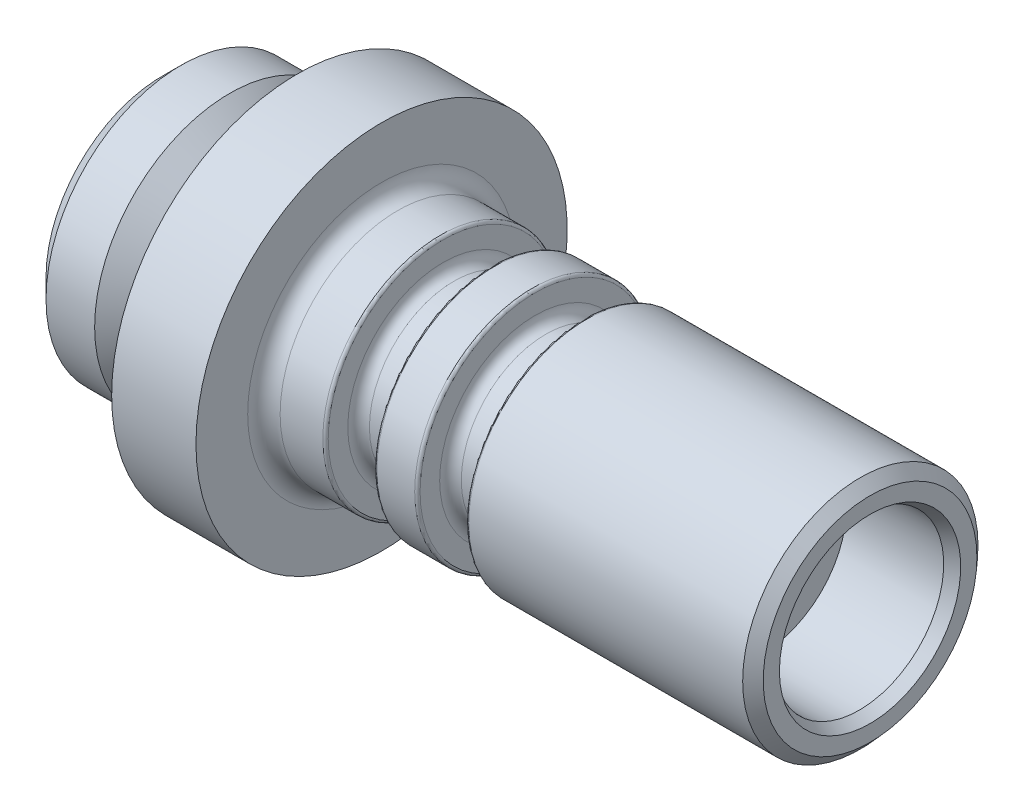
ISO-10303-21;
HEADER;
FILE_DESCRIPTION(('STEP AP214'),'2;1');
FILE_NAME('part.step','',(''),(''),'','','');
FILE_SCHEMA(('AUTOMOTIVE_DESIGN { 1 0 10303 214 1 1 1 1 }'));
ENDSEC;
DATA;
#1=APPLICATION_CONTEXT('core data for automotive mechanical design processes');
#2=APPLICATION_PROTOCOL_DEFINITION('international standard','automotive_design',2000,#1);
#3=PRODUCT_CONTEXT('',#1,'mechanical');
#4=PRODUCT('Part','Part','',(#3));
#5=PRODUCT_RELATED_PRODUCT_CATEGORY('part','',(#4));
#6=PRODUCT_DEFINITION_FORMATION('','',#4);
#7=PRODUCT_DEFINITION_CONTEXT('part definition',#1,'design');
#8=PRODUCT_DEFINITION('design','',#6,#7);
#9=PRODUCT_DEFINITION_SHAPE('','',#8);
#10=(LENGTH_UNIT() NAMED_UNIT(*) SI_UNIT(.MILLI.,.METRE.));
#11=(NAMED_UNIT(*) PLANE_ANGLE_UNIT() SI_UNIT($,.RADIAN.));
#12=(NAMED_UNIT(*) SI_UNIT($,.STERADIAN.) SOLID_ANGLE_UNIT());
#13=UNCERTAINTY_MEASURE_WITH_UNIT(LENGTH_MEASURE(1.E-05),#10,'distance_accuracy_value','');
#14=(GEOMETRIC_REPRESENTATION_CONTEXT(3) GLOBAL_UNCERTAINTY_ASSIGNED_CONTEXT((#13)) GLOBAL_UNIT_ASSIGNED_CONTEXT((#10,
#11,#12)) REPRESENTATION_CONTEXT('',''));
#15=CARTESIAN_POINT('',(0.,0.,0.));
#16=DIRECTION('',(0.,0.,1.));
#17=DIRECTION('',(1.,0.,0.));
#18=AXIS2_PLACEMENT_3D('',#15,#16,#17);
#19=CARTESIAN_POINT('',(33.274,0.,0.));
#20=DIRECTION('',(1.,0.,0.));
#21=DIRECTION('',(0.,0.,-1.));
#22=AXIS2_PLACEMENT_3D('',#19,#20,#21);
#23=PLANE('',#22);
#24=CARTESIAN_POINT('',(33.274,0.,0.));
#25=DIRECTION('',(1.,0.,0.));
#26=DIRECTION('',(0.,0.,-1.));
#27=AXIS2_PLACEMENT_3D('',#24,#25,#26);
#28=CIRCLE('',#27,5.02285);
#29=CARTESIAN_POINT('',(33.274,0.,-5.02285));
#30=VERTEX_POINT('',#29);
#31=EDGE_CURVE('E42',#30,#30,#28,.T.);
#32=ORIENTED_EDGE('',*,*,#31,.T.);
#33=EDGE_LOOP('',(#32));
#34=FACE_BOUND('',#33,.T.);
#35=CARTESIAN_POINT('',(33.274,0.,0.));
#36=DIRECTION('',(-1.,0.,0.));
#37=DIRECTION('',(0.,0.,1.));
#38=AXIS2_PLACEMENT_3D('',#35,#36,#37);
#39=CIRCLE('',#38,4.26204393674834);
#40=CARTESIAN_POINT('',(33.274,0.,4.26204393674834));
#41=VERTEX_POINT('',#40);
#42=EDGE_CURVE('E52',#41,#41,#39,.T.);
#43=ORIENTED_EDGE('',*,*,#42,.T.);
#44=EDGE_LOOP('',(#43));
#45=FACE_BOUND('',#44,.T.);
#46=ADVANCED_FACE('F31',(#34,#45),#23,.T.);
#47=CARTESIAN_POINT('',(33.274,0.,0.));
#48=DIRECTION('',(-1.,0.,0.));
#49=DIRECTION('',(0.,0.,1.));
#50=AXIS2_PLACEMENT_3D('',#47,#48,#49);
#51=CYLINDRICAL_SURFACE('',#50,2.7051);
#52=CARTESIAN_POINT('',(10.3509678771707,0.,0.));
#53=DIRECTION('',(-1.,0.,0.));
#54=DIRECTION('',(0.,0.,1.));
#55=AXIS2_PLACEMENT_3D('',#52,#53,#54);
#56=CIRCLE('',#55,2.7051);
#57=CARTESIAN_POINT('',(10.3509678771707,0.,2.7051));
#58=VERTEX_POINT('',#57);
#59=EDGE_CURVE('E49',#58,#58,#56,.F.);
#60=ORIENTED_EDGE('',*,*,#59,.F.);
#61=EDGE_LOOP('',(#60));
#62=FACE_BOUND('',#61,.T.);
#63=CARTESIAN_POINT('',(28.194,0.,0.));
#64=DIRECTION('',(1.,0.,0.));
#65=DIRECTION('',(0.,0.,-1.));
#66=AXIS2_PLACEMENT_3D('',#63,#64,#65);
#67=CIRCLE('',#66,2.7051);
#68=CARTESIAN_POINT('',(28.194,0.,-2.7051));
#69=VERTEX_POINT('',#68);
#70=EDGE_CURVE('E54',#69,#69,#67,.T.);
#71=ORIENTED_EDGE('',*,*,#70,.T.);
#72=EDGE_LOOP('',(#71));
#73=FACE_BOUND('',#72,.T.);
#74=ADVANCED_FACE('F162',(#62,#73),#51,.F.);
#75=CARTESIAN_POINT('',(0.,0.,0.));
#76=DIRECTION('',(-1.,0.,0.));
#77=DIRECTION('',(0.,0.,1.));
#78=AXIS2_PLACEMENT_3D('',#75,#76,#77);
#79=CYLINDRICAL_SURFACE('',#78,5.53085);
#80=CARTESIAN_POINT('',(11.0744,0.,0.));
#81=DIRECTION('',(1.,0.,0.));
#82=DIRECTION('',(0.,0.,-1.));
#83=AXIS2_PLACEMENT_3D('',#80,#81,#82);
#84=CIRCLE('',#83,5.53085);
#85=CARTESIAN_POINT('',(11.0744,0.,-5.53085));
#86=VERTEX_POINT('',#85);
#87=EDGE_CURVE('E67',#86,#86,#84,.T.);
#88=ORIENTED_EDGE('',*,*,#87,.T.);
#89=EDGE_LOOP('',(#88));
#90=FACE_BOUND('',#89,.T.);
#91=CARTESIAN_POINT('',(13.081,0.,0.));
#92=DIRECTION('',(-1.,0.,0.));
#93=DIRECTION('',(0.,0.,1.));
#94=AXIS2_PLACEMENT_3D('',#91,#92,#93);
#95=CIRCLE('',#94,5.53085);
#96=CARTESIAN_POINT('',(13.081,0.,5.53085));
#97=VERTEX_POINT('',#96);
#98=EDGE_CURVE('E130',#97,#97,#95,.T.);
#99=ORIENTED_EDGE('',*,*,#98,.T.);
#100=EDGE_LOOP('',(#99));
#101=FACE_BOUND('',#100,.T.);
#102=ADVANCED_FACE('F168',(#90,#101),#79,.T.);
#103=CARTESIAN_POINT('',(15.621,0.,0.));
#104=DIRECTION('',(-1.,0.,0.));
#105=DIRECTION('',(0.,0.,1.));
#106=AXIS2_PLACEMENT_3D('',#103,#104,#105);
#107=CIRCLE('',#106,5.53085);
#108=CARTESIAN_POINT('',(15.621,0.,5.53085));
#109=VERTEX_POINT('',#108);
#110=EDGE_CURVE('E127',#109,#109,#107,.T.);
#111=ORIENTED_EDGE('',*,*,#110,.F.);
#112=EDGE_LOOP('',(#111));
#113=FACE_BOUND('',#112,.T.);
#114=CARTESIAN_POINT('',(17.399,0.,0.));
#115=DIRECTION('',(-1.,0.,0.));
#116=DIRECTION('',(0.,0.,1.));
#117=AXIS2_PLACEMENT_3D('',#114,#115,#116);
#118=CIRCLE('',#117,5.53085);
#119=CARTESIAN_POINT('',(17.399,0.,5.53085));
#120=VERTEX_POINT('',#119);
#121=EDGE_CURVE('E91',#120,#120,#118,.T.);
#122=ORIENTED_EDGE('',*,*,#121,.T.);
#123=EDGE_LOOP('',(#122));
#124=FACE_BOUND('',#123,.T.);
#125=ADVANCED_FACE('F182',(#113,#124),#79,.T.);
#126=CARTESIAN_POINT('',(33.274,0.,0.));
#127=DIRECTION('',(-1.,0.,0.));
#128=DIRECTION('',(0.,0.,1.));
#129=AXIS2_PLACEMENT_3D('',#126,#127,#128);
#130=CYLINDRICAL_SURFACE('',#129,8.7249);
#131=CARTESIAN_POINT('',(6.35,0.,0.));
#132=DIRECTION('',(-1.,0.,0.));
#133=DIRECTION('',(0.,0.,1.));
#134=AXIS2_PLACEMENT_3D('',#131,#132,#133);
#135=CIRCLE('',#134,8.7249);
#136=CARTESIAN_POINT('',(6.35,0.,8.7249));
#137=VERTEX_POINT('',#136);
#138=EDGE_CURVE('E73',#137,#137,#135,.T.);
#139=ORIENTED_EDGE('',*,*,#138,.F.);
#140=EDGE_LOOP('',(#139));
#141=FACE_BOUND('',#140,.T.);
#142=CARTESIAN_POINT('',(10.3124,0.,0.));
#143=DIRECTION('',(-1.,0.,0.));
#144=DIRECTION('',(0.,0.,1.));
#145=AXIS2_PLACEMENT_3D('',#142,#143,#144);
#146=CIRCLE('',#145,8.7249);
#147=CARTESIAN_POINT('',(10.3124,0.,8.7249));
#148=VERTEX_POINT('',#147);
#149=EDGE_CURVE('E88',#148,#148,#146,.T.);
#150=ORIENTED_EDGE('',*,*,#149,.T.);
#151=EDGE_LOOP('',(#150));
#152=FACE_BOUND('',#151,.T.);
#153=ADVANCED_FACE('F179',(#141,#152),#130,.T.);
#154=CARTESIAN_POINT('',(0.,0.,0.));
#155=DIRECTION('',(1.,0.,0.));
#156=DIRECTION('',(0.,0.,-1.));
#157=AXIS2_PLACEMENT_3D('',#154,#155,#156);
#158=PLANE('',#157);
#159=CARTESIAN_POINT('',(0.,0.,0.));
#160=DIRECTION('',(1.,0.,0.));
#161=DIRECTION('',(0.,0.,-1.));
#162=AXIS2_PLACEMENT_3D('',#159,#160,#161);
#163=CIRCLE('',#162,4.4325052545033);
#164=CARTESIAN_POINT('',(0.,0.,-4.4325052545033));
#165=VERTEX_POINT('',#164);
#166=EDGE_CURVE('E38',#165,#165,#163,.T.);
#167=ORIENTED_EDGE('',*,*,#166,.T.);
#168=EDGE_LOOP('',(#167));
#169=FACE_BOUND('',#168,.T.);
#170=CARTESIAN_POINT('',(0.,0.,0.));
#171=DIRECTION('',(-1.,0.,0.));
#172=DIRECTION('',(0.,0.,1.));
#173=AXIS2_PLACEMENT_3D('',#170,#171,#172);
#174=CIRCLE('',#173,5.461);
#175=CARTESIAN_POINT('',(0.,0.,5.461));
#176=VERTEX_POINT('',#175);
#177=EDGE_CURVE('E85',#176,#176,#174,.T.);
#178=ORIENTED_EDGE('',*,*,#177,.T.);
#179=EDGE_LOOP('',(#178));
#180=FACE_BOUND('',#179,.T.);
#181=ADVANCED_FACE('F176',(#169,#180),#158,.F.);
#182=CARTESIAN_POINT('',(6.35,5.461,0.));
#183=DIRECTION('',(-1.,0.,0.));
#184=DIRECTION('',(0.,0.,1.));
#185=AXIS2_PLACEMENT_3D('',#182,#183,#184);
#186=PLANE('',#185);
#187=CARTESIAN_POINT('',(6.35,0.,0.));
#188=DIRECTION('',(-1.,0.,0.));
#189=DIRECTION('',(0.,0.,1.));
#190=AXIS2_PLACEMENT_3D('',#187,#188,#189);
#191=CIRCLE('',#190,6.223);
#192=CARTESIAN_POINT('',(6.35,0.,6.223));
#193=VERTEX_POINT('',#192);
#194=EDGE_CURVE('E61',#193,#193,#191,.F.);
#195=ORIENTED_EDGE('',*,*,#194,.T.);
#196=EDGE_LOOP('',(#195));
#197=FACE_BOUND('',#196,.T.);
#198=ORIENTED_EDGE('',*,*,#138,.T.);
#199=EDGE_LOOP('',(#198));
#200=FACE_BOUND('',#199,.T.);
#201=ADVANCED_FACE('F174',(#197,#200),#186,.T.);
#202=CARTESIAN_POINT('',(0.,0.,0.));
#203=DIRECTION('',(-1.,0.,0.));
#204=DIRECTION('',(0.,0.,1.));
#205=AXIS2_PLACEMENT_3D('',#202,#203,#204);
#206=CYLINDRICAL_SURFACE('',#205,5.461);
#207=CARTESIAN_POINT('',(5.588,0.,0.));
#208=DIRECTION('',(-1.,0.,0.));
#209=DIRECTION('',(0.,0.,1.));
#210=AXIS2_PLACEMENT_3D('',#207,#208,#209);
#211=CIRCLE('',#210,5.461);
#212=CARTESIAN_POINT('',(5.588,0.,5.461));
#213=VERTEX_POINT('',#212);
#214=EDGE_CURVE('E64',#213,#213,#211,.T.);
#215=ORIENTED_EDGE('',*,*,#214,.T.);
#216=EDGE_LOOP('',(#215));
#217=FACE_BOUND('',#216,.T.);
#218=CARTESIAN_POINT('',(4.064,0.,0.));
#219=DIRECTION('',(-1.,0.,0.));
#220=DIRECTION('',(0.,0.,1.));
#221=AXIS2_PLACEMENT_3D('',#218,#219,#220);
#222=CIRCLE('',#221,5.461);
#223=CARTESIAN_POINT('',(4.064,0.,5.461));
#224=VERTEX_POINT('',#223);
#225=EDGE_CURVE('E76',#224,#224,#222,.T.);
#226=ORIENTED_EDGE('',*,*,#225,.F.);
#227=EDGE_LOOP('',(#226));
#228=FACE_BOUND('',#227,.T.);
#229=ADVANCED_FACE('F281',(#217,#228),#206,.T.);
#230=CARTESIAN_POINT('',(3.175,0.,0.));
#231=DIRECTION('',(-1.,0.,0.));
#232=DIRECTION('',(0.,0.,1.));
#233=AXIS2_PLACEMENT_3D('',#230,#231,#232);
#234=CONICAL_SURFACE('',#233,6.35,0.78539816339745);
#235=ORIENTED_EDGE('',*,*,#225,.T.);
#236=EDGE_LOOP('',(#235));
#237=FACE_BOUND('',#236,.T.);
#238=CARTESIAN_POINT('',(3.175,0.,0.));
#239=DIRECTION('',(-1.,0.,0.));
#240=DIRECTION('',(0.,0.,1.));
#241=AXIS2_PLACEMENT_3D('',#238,#239,#240);
#242=CIRCLE('',#241,6.35);
#243=CARTESIAN_POINT('',(3.175,0.,6.35));
#244=VERTEX_POINT('',#243);
#245=EDGE_CURVE('E79',#244,#244,#242,.T.);
#246=ORIENTED_EDGE('',*,*,#245,.F.);
#247=EDGE_LOOP('',(#246));
#248=FACE_BOUND('',#247,.T.);
#249=ADVANCED_FACE('F278',(#237,#248),#234,.T.);
#250=CARTESIAN_POINT('',(0.,0.,0.));
#251=DIRECTION('',(-1.,0.,0.));
#252=DIRECTION('',(0.,0.,1.));
#253=AXIS2_PLACEMENT_3D('',#250,#251,#252);
#254=CYLINDRICAL_SURFACE('',#253,6.35);
#255=ORIENTED_EDGE('',*,*,#245,.T.);
#256=EDGE_LOOP('',(#255));
#257=FACE_BOUND('',#256,.T.);
#258=CARTESIAN_POINT('',(0.888999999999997,0.,0.));
#259=DIRECTION('',(-1.,0.,0.));
#260=DIRECTION('',(0.,0.,1.));
#261=AXIS2_PLACEMENT_3D('',#258,#259,#260);
#262=CIRCLE('',#261,6.35);
#263=CARTESIAN_POINT('',(0.888999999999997,0.,6.35));
#264=VERTEX_POINT('',#263);
#265=EDGE_CURVE('E82',#264,#264,#262,.T.);
#266=ORIENTED_EDGE('',*,*,#265,.F.);
#267=EDGE_LOOP('',(#266));
#268=FACE_BOUND('',#267,.T.);
#269=ADVANCED_FACE('F274',(#257,#268),#254,.T.);
#270=CARTESIAN_POINT('',(0.,0.,0.));
#271=DIRECTION('',(1.,0.,0.));
#272=DIRECTION('',(0.,0.,-1.));
#273=AXIS2_PLACEMENT_3D('',#270,#271,#272);
#274=CONICAL_SURFACE('',#273,5.461,0.78539816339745);
#275=ORIENTED_EDGE('',*,*,#265,.T.);
#276=EDGE_LOOP('',(#275));
#277=FACE_BOUND('',#276,.T.);
#278=ORIENTED_EDGE('',*,*,#177,.F.);
#279=EDGE_LOOP('',(#278));
#280=FACE_BOUND('',#279,.T.);
#281=ADVANCED_FACE('F269',(#277,#280),#274,.T.);
#282=CARTESIAN_POINT('',(10.3124,8.7249,0.));
#283=DIRECTION('',(1.,0.,0.));
#284=DIRECTION('',(0.,0.,-1.));
#285=AXIS2_PLACEMENT_3D('',#282,#283,#284);
#286=PLANE('',#285);
#287=CARTESIAN_POINT('',(10.3124,0.,0.));
#288=DIRECTION('',(1.,0.,0.));
#289=DIRECTION('',(0.,0.,-1.));
#290=AXIS2_PLACEMENT_3D('',#287,#288,#289);
#291=CIRCLE('',#290,6.29285);
#292=CARTESIAN_POINT('',(10.3124,0.,-6.29285));
#293=VERTEX_POINT('',#292);
#294=EDGE_CURVE('E70',#293,#293,#291,.F.);
#295=ORIENTED_EDGE('',*,*,#294,.T.);
#296=EDGE_LOOP('',(#295));
#297=FACE_BOUND('',#296,.T.);
#298=ORIENTED_EDGE('',*,*,#149,.F.);
#299=EDGE_LOOP('',(#298));
#300=FACE_BOUND('',#299,.T.);
#301=ADVANCED_FACE('F214',(#297,#300),#286,.T.);
#302=CARTESIAN_POINT('',(32.8165947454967,0.,0.));
#303=DIRECTION('',(1.,0.,0.));
#304=DIRECTION('',(0.,0.,-1.));
#305=AXIS2_PLACEMENT_3D('',#302,#303,#304);
#306=CIRCLE('',#305,5.53085);
#307=CARTESIAN_POINT('',(32.8165947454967,0.,-5.53085));
#308=VERTEX_POINT('',#307);
#309=EDGE_CURVE('E46',#308,#308,#306,.F.);
#310=ORIENTED_EDGE('',*,*,#309,.T.);
#311=EDGE_LOOP('',(#310));
#312=FACE_BOUND('',#311,.T.);
#313=CARTESIAN_POINT('',(19.939,0.,0.));
#314=DIRECTION('',(-1.,0.,0.));
#315=DIRECTION('',(0.,0.,1.));
#316=AXIS2_PLACEMENT_3D('',#313,#314,#315);
#317=CIRCLE('',#316,5.53085);
#318=CARTESIAN_POINT('',(19.939,0.,5.53085));
#319=VERTEX_POINT('',#318);
#320=EDGE_CURVE('E94',#319,#319,#317,.T.);
#321=ORIENTED_EDGE('',*,*,#320,.F.);
#322=EDGE_LOOP('',(#321));
#323=FACE_BOUND('',#322,.T.);
#324=ADVANCED_FACE('F188',(#312,#323),#79,.T.);
#325=CARTESIAN_POINT('',(11.0744,0.,0.));
#326=DIRECTION('',(1.,0.,0.));
#327=DIRECTION('',(0.,0.,-1.));
#328=AXIS2_PLACEMENT_3D('',#325,#326,#327);
#329=TOROIDAL_SURFACE('',#328,6.29285,0.762);
#330=ORIENTED_EDGE('',*,*,#87,.F.);
#331=EDGE_LOOP('',(#330));
#332=FACE_BOUND('',#331,.T.);
#333=ORIENTED_EDGE('',*,*,#294,.F.);
#334=EDGE_LOOP('',(#333));
#335=FACE_BOUND('',#334,.T.);
#336=ADVANCED_FACE('F184',(#332,#335),#329,.F.);
#337=CARTESIAN_POINT('',(5.588,0.,0.));
#338=DIRECTION('',(-1.,0.,0.));
#339=DIRECTION('',(0.,0.,1.));
#340=AXIS2_PLACEMENT_3D('',#337,#338,#339);
#341=TOROIDAL_SURFACE('',#340,6.223,0.762);
#342=ORIENTED_EDGE('',*,*,#194,.F.);
#343=EDGE_LOOP('',(#342));
#344=FACE_BOUND('',#343,.T.);
#345=ORIENTED_EDGE('',*,*,#214,.F.);
#346=EDGE_LOOP('',(#345));
#347=FACE_BOUND('',#346,.T.);
#348=ADVANCED_FACE('F187',(#344,#347),#341,.F.);
#349=CARTESIAN_POINT('',(17.399,0.,0.));
#350=DIRECTION('',(-1.,0.,0.));
#351=DIRECTION('',(0.,0.,1.));
#352=AXIS2_PLACEMENT_3D('',#349,#350,#351);
#353=TOROIDAL_SURFACE('',#352,5.40385,0.126999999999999);
#354=CARTESIAN_POINT('',(17.526,0.,0.));
#355=DIRECTION('',(-1.,0.,0.));
#356=DIRECTION('',(0.,0.,1.));
#357=AXIS2_PLACEMENT_3D('',#354,#355,#356);
#358=CIRCLE('',#357,5.40385);
#359=CARTESIAN_POINT('',(17.526,0.,5.40385));
#360=VERTEX_POINT('',#359);
#361=EDGE_CURVE('E112',#360,#360,#358,.T.);
#362=ORIENTED_EDGE('',*,*,#361,.T.);
#363=EDGE_LOOP('',(#362));
#364=FACE_BOUND('',#363,.T.);
#365=ORIENTED_EDGE('',*,*,#121,.F.);
#366=EDGE_LOOP('',(#365));
#367=FACE_BOUND('',#366,.T.);
#368=ADVANCED_FACE('F191',(#364,#367),#353,.T.);
#369=CARTESIAN_POINT('',(19.939,0.,0.));
#370=DIRECTION('',(-1.,0.,0.));
#371=DIRECTION('',(0.,0.,1.));
#372=AXIS2_PLACEMENT_3D('',#369,#370,#371);
#373=TOROIDAL_SURFACE('',#372,5.40385,0.127);
#374=ORIENTED_EDGE('',*,*,#320,.T.);
#375=EDGE_LOOP('',(#374));
#376=FACE_BOUND('',#375,.T.);
#377=CARTESIAN_POINT('',(19.812,0.,0.));
#378=DIRECTION('',(-1.,0.,0.));
#379=DIRECTION('',(0.,0.,1.));
#380=AXIS2_PLACEMENT_3D('',#377,#378,#379);
#381=CIRCLE('',#380,5.40385);
#382=CARTESIAN_POINT('',(19.812,0.,5.40385));
#383=VERTEX_POINT('',#382);
#384=EDGE_CURVE('E97',#383,#383,#381,.T.);
#385=ORIENTED_EDGE('',*,*,#384,.F.);
#386=EDGE_LOOP('',(#385));
#387=FACE_BOUND('',#386,.T.);
#388=ADVANCED_FACE('F218',(#376,#387),#373,.T.);
#389=CARTESIAN_POINT('',(19.812,4.4831,0.));
#390=DIRECTION('',(-1.,0.,0.));
#391=DIRECTION('',(0.,0.,1.));
#392=AXIS2_PLACEMENT_3D('',#389,#390,#391);
#393=PLANE('',#392);
#394=ORIENTED_EDGE('',*,*,#384,.T.);
#395=EDGE_LOOP('',(#394));
#396=FACE_BOUND('',#395,.T.);
#397=CARTESIAN_POINT('',(19.812,0.,0.));
#398=DIRECTION('',(-1.,0.,0.));
#399=DIRECTION('',(0.,0.,1.));
#400=AXIS2_PLACEMENT_3D('',#397,#398,#399);
#401=CIRCLE('',#400,4.4831);
#402=CARTESIAN_POINT('',(19.812,0.,4.4831));
#403=VERTEX_POINT('',#402);
#404=EDGE_CURVE('E100',#403,#403,#401,.T.);
#405=ORIENTED_EDGE('',*,*,#404,.F.);
#406=EDGE_LOOP('',(#405));
#407=FACE_BOUND('',#406,.T.);
#408=ADVANCED_FACE('F221',(#396,#407),#393,.T.);
#409=CARTESIAN_POINT('',(19.304,0.,0.));
#410=DIRECTION('',(-1.,0.,0.));
#411=DIRECTION('',(0.,0.,1.));
#412=AXIS2_PLACEMENT_3D('',#409,#410,#411);
#413=TOROIDAL_SURFACE('',#412,4.4831,0.508000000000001);
#414=ORIENTED_EDGE('',*,*,#404,.T.);
#415=EDGE_LOOP('',(#414));
#416=FACE_BOUND('',#415,.T.);
#417=CARTESIAN_POINT('',(19.304,0.,0.));
#418=DIRECTION('',(-1.,0.,0.));
#419=DIRECTION('',(0.,0.,1.));
#420=AXIS2_PLACEMENT_3D('',#417,#418,#419);
#421=CIRCLE('',#420,3.9751);
#422=CARTESIAN_POINT('',(19.304,0.,3.9751));
#423=VERTEX_POINT('',#422);
#424=EDGE_CURVE('E103',#423,#423,#421,.T.);
#425=ORIENTED_EDGE('',*,*,#424,.F.);
#426=EDGE_LOOP('',(#425));
#427=FACE_BOUND('',#426,.T.);
#428=ADVANCED_FACE('F227',(#416,#427),#413,.F.);
#429=CARTESIAN_POINT('',(0.,0.,0.));
#430=DIRECTION('',(-1.,0.,0.));
#431=DIRECTION('',(0.,0.,1.));
#432=AXIS2_PLACEMENT_3D('',#429,#430,#431);
#433=CYLINDRICAL_SURFACE('',#432,3.9751);
#434=ORIENTED_EDGE('',*,*,#424,.T.);
#435=EDGE_LOOP('',(#434));
#436=FACE_BOUND('',#435,.T.);
#437=CARTESIAN_POINT('',(18.034,0.,0.));
#438=DIRECTION('',(-1.,0.,0.));
#439=DIRECTION('',(0.,0.,1.));
#440=AXIS2_PLACEMENT_3D('',#437,#438,#439);
#441=CIRCLE('',#440,3.9751);
#442=CARTESIAN_POINT('',(18.034,0.,3.9751));
#443=VERTEX_POINT('',#442);
#444=EDGE_CURVE('E106',#443,#443,#441,.T.);
#445=ORIENTED_EDGE('',*,*,#444,.F.);
#446=EDGE_LOOP('',(#445));
#447=FACE_BOUND('',#446,.T.);
#448=ADVANCED_FACE('F233',(#436,#447),#433,.T.);
#449=CARTESIAN_POINT('',(18.034,0.,0.));
#450=DIRECTION('',(-1.,0.,0.));
#451=DIRECTION('',(0.,0.,1.));
#452=AXIS2_PLACEMENT_3D('',#449,#450,#451);
#453=TOROIDAL_SURFACE('',#452,4.4831,0.508000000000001);
#454=ORIENTED_EDGE('',*,*,#444,.T.);
#455=EDGE_LOOP('',(#454));
#456=FACE_BOUND('',#455,.T.);
#457=CARTESIAN_POINT('',(17.526,0.,0.));
#458=DIRECTION('',(-1.,0.,0.));
#459=DIRECTION('',(0.,0.,1.));
#460=AXIS2_PLACEMENT_3D('',#457,#458,#459);
#461=CIRCLE('',#460,4.4831);
#462=CARTESIAN_POINT('',(17.526,0.,4.4831));
#463=VERTEX_POINT('',#462);
#464=EDGE_CURVE('E109',#463,#463,#461,.T.);
#465=ORIENTED_EDGE('',*,*,#464,.F.);
#466=EDGE_LOOP('',(#465));
#467=FACE_BOUND('',#466,.T.);
#468=ADVANCED_FACE('F239',(#456,#467),#453,.F.);
#469=CARTESIAN_POINT('',(17.526,5.40385,0.));
#470=DIRECTION('',(1.,0.,0.));
#471=DIRECTION('',(0.,0.,-1.));
#472=AXIS2_PLACEMENT_3D('',#469,#470,#471);
#473=PLANE('',#472);
#474=ORIENTED_EDGE('',*,*,#464,.T.);
#475=EDGE_LOOP('',(#474));
#476=FACE_BOUND('',#475,.T.);
#477=ORIENTED_EDGE('',*,*,#361,.F.);
#478=EDGE_LOOP('',(#477));
#479=FACE_BOUND('',#478,.T.);
#480=ADVANCED_FACE('F245',(#476,#479),#473,.T.);
#481=CARTESIAN_POINT('',(13.716,0.,0.));
#482=DIRECTION('',(-1.,0.,0.));
#483=DIRECTION('',(0.,0.,1.));
#484=AXIS2_PLACEMENT_3D('',#481,#482,#483);
#485=TOROIDAL_SURFACE('',#484,4.4831,0.508);
#486=CARTESIAN_POINT('',(13.716,0.,0.));
#487=DIRECTION('',(-1.,0.,0.));
#488=DIRECTION('',(0.,0.,1.));
#489=AXIS2_PLACEMENT_3D('',#486,#487,#488);
#490=CIRCLE('',#489,3.9751);
#491=CARTESIAN_POINT('',(13.716,0.,3.9751));
#492=VERTEX_POINT('',#491);
#493=EDGE_CURVE('E115',#492,#492,#490,.T.);
#494=ORIENTED_EDGE('',*,*,#493,.T.);
#495=EDGE_LOOP('',(#494));
#496=FACE_BOUND('',#495,.T.);
#497=CARTESIAN_POINT('',(13.208,0.,0.));
#498=DIRECTION('',(-1.,0.,0.));
#499=DIRECTION('',(0.,0.,1.));
#500=AXIS2_PLACEMENT_3D('',#497,#498,#499);
#501=CIRCLE('',#500,4.4831);
#502=CARTESIAN_POINT('',(13.208,0.,4.4831));
#503=VERTEX_POINT('',#502);
#504=EDGE_CURVE('E56',#503,#503,#501,.T.);
#505=ORIENTED_EDGE('',*,*,#504,.F.);
#506=EDGE_LOOP('',(#505));
#507=FACE_BOUND('',#506,.T.);
#508=ADVANCED_FACE('F251',(#496,#507),#485,.F.);
#509=CARTESIAN_POINT('',(0.,0.,0.));
#510=DIRECTION('',(-1.,0.,0.));
#511=DIRECTION('',(0.,0.,1.));
#512=AXIS2_PLACEMENT_3D('',#509,#510,#511);
#513=CYLINDRICAL_SURFACE('',#512,3.9751);
#514=CARTESIAN_POINT('',(14.986,0.,0.));
#515=DIRECTION('',(-1.,0.,0.));
#516=DIRECTION('',(0.,0.,1.));
#517=AXIS2_PLACEMENT_3D('',#514,#515,#516);
#518=CIRCLE('',#517,3.9751);
#519=CARTESIAN_POINT('',(14.986,0.,3.9751));
#520=VERTEX_POINT('',#519);
#521=EDGE_CURVE('E118',#520,#520,#518,.T.);
#522=ORIENTED_EDGE('',*,*,#521,.T.);
#523=EDGE_LOOP('',(#522));
#524=FACE_BOUND('',#523,.T.);
#525=ORIENTED_EDGE('',*,*,#493,.F.);
#526=EDGE_LOOP('',(#525));
#527=FACE_BOUND('',#526,.T.);
#528=ADVANCED_FACE('F421',(#524,#527),#513,.T.);
#529=CARTESIAN_POINT('',(14.986,0.,0.));
#530=DIRECTION('',(-1.,0.,0.));
#531=DIRECTION('',(0.,0.,1.));
#532=AXIS2_PLACEMENT_3D('',#529,#530,#531);
#533=TOROIDAL_SURFACE('',#532,4.4831,0.507999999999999);
#534=CARTESIAN_POINT('',(15.494,0.,0.));
#535=DIRECTION('',(-1.,0.,0.));
#536=DIRECTION('',(0.,0.,1.));
#537=AXIS2_PLACEMENT_3D('',#534,#535,#536);
#538=CIRCLE('',#537,4.4831);
#539=CARTESIAN_POINT('',(15.494,0.,4.4831));
#540=VERTEX_POINT('',#539);
#541=EDGE_CURVE('E121',#540,#540,#538,.T.);
#542=ORIENTED_EDGE('',*,*,#541,.T.);
#543=EDGE_LOOP('',(#542));
#544=FACE_BOUND('',#543,.T.);
#545=ORIENTED_EDGE('',*,*,#521,.F.);
#546=EDGE_LOOP('',(#545));
#547=FACE_BOUND('',#546,.T.);
#548=ADVANCED_FACE('F431',(#544,#547),#533,.F.);
#549=CARTESIAN_POINT('',(15.494,4.4831,0.));
#550=DIRECTION('',(-1.,0.,0.));
#551=DIRECTION('',(0.,0.,1.));
#552=AXIS2_PLACEMENT_3D('',#549,#550,#551);
#553=PLANE('',#552);
#554=CARTESIAN_POINT('',(15.494,0.,0.));
#555=DIRECTION('',(-1.,0.,0.));
#556=DIRECTION('',(0.,0.,1.));
#557=AXIS2_PLACEMENT_3D('',#554,#555,#556);
#558=CIRCLE('',#557,5.40385);
#559=CARTESIAN_POINT('',(15.494,0.,5.40385));
#560=VERTEX_POINT('',#559);
#561=EDGE_CURVE('E124',#560,#560,#558,.T.);
#562=ORIENTED_EDGE('',*,*,#561,.T.);
#563=EDGE_LOOP('',(#562));
#564=FACE_BOUND('',#563,.T.);
#565=ORIENTED_EDGE('',*,*,#541,.F.);
#566=EDGE_LOOP('',(#565));
#567=FACE_BOUND('',#566,.T.);
#568=ADVANCED_FACE('F441',(#564,#567),#553,.T.);
#569=CARTESIAN_POINT('',(15.621,0.,0.));
#570=DIRECTION('',(-1.,0.,0.));
#571=DIRECTION('',(0.,0.,1.));
#572=AXIS2_PLACEMENT_3D('',#569,#570,#571);
#573=TOROIDAL_SURFACE('',#572,5.40385,0.126999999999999);
#574=ORIENTED_EDGE('',*,*,#110,.T.);
#575=EDGE_LOOP('',(#574));
#576=FACE_BOUND('',#575,.T.);
#577=ORIENTED_EDGE('',*,*,#561,.F.);
#578=EDGE_LOOP('',(#577));
#579=FACE_BOUND('',#578,.T.);
#580=ADVANCED_FACE('F451',(#576,#579),#573,.T.);
#581=CARTESIAN_POINT('',(13.081,0.,0.));
#582=DIRECTION('',(-1.,0.,0.));
#583=DIRECTION('',(0.,0.,1.));
#584=AXIS2_PLACEMENT_3D('',#581,#582,#583);
#585=TOROIDAL_SURFACE('',#584,5.40385,0.127000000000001);
#586=CARTESIAN_POINT('',(13.208,0.,0.));
#587=DIRECTION('',(-1.,0.,0.));
#588=DIRECTION('',(0.,0.,1.));
#589=AXIS2_PLACEMENT_3D('',#586,#587,#588);
#590=CIRCLE('',#589,5.40385);
#591=CARTESIAN_POINT('',(13.208,0.,5.40385));
#592=VERTEX_POINT('',#591);
#593=EDGE_CURVE('E133',#592,#592,#590,.T.);
#594=ORIENTED_EDGE('',*,*,#593,.T.);
#595=EDGE_LOOP('',(#594));
#596=FACE_BOUND('',#595,.T.);
#597=ORIENTED_EDGE('',*,*,#98,.F.);
#598=EDGE_LOOP('',(#597));
#599=FACE_BOUND('',#598,.T.);
#600=ADVANCED_FACE('F205',(#596,#599),#585,.T.);
#601=CARTESIAN_POINT('',(13.208,5.40385,0.));
#602=DIRECTION('',(1.,0.,0.));
#603=DIRECTION('',(0.,0.,-1.));
#604=AXIS2_PLACEMENT_3D('',#601,#602,#603);
#605=PLANE('',#604);
#606=ORIENTED_EDGE('',*,*,#504,.T.);
#607=EDGE_LOOP('',(#606));
#608=FACE_BOUND('',#607,.T.);
#609=ORIENTED_EDGE('',*,*,#593,.F.);
#610=EDGE_LOOP('',(#609));
#611=FACE_BOUND('',#610,.T.);
#612=ADVANCED_FACE('F196',(#608,#611),#605,.T.);
#613=CARTESIAN_POINT('',(32.8165947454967,0.,0.));
#614=DIRECTION('',(-1.,0.,0.));
#615=DIRECTION('',(0.,0.,1.));
#616=AXIS2_PLACEMENT_3D('',#613,#614,#615);
#617=CONICAL_SURFACE('',#616,5.53085,0.83775804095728);
#618=ORIENTED_EDGE('',*,*,#31,.F.);
#619=EDGE_LOOP('',(#618));
#620=FACE_BOUND('',#619,.T.);
#621=ORIENTED_EDGE('',*,*,#309,.F.);
#622=EDGE_LOOP('',(#621));
#623=FACE_BOUND('',#622,.T.);
#624=ADVANCED_FACE('F193',(#620,#623),#617,.T.);
#625=CARTESIAN_POINT('',(28.194,3.96875,0.));
#626=DIRECTION('',(1.,0.,0.));
#627=DIRECTION('',(0.,0.,-1.));
#628=AXIS2_PLACEMENT_3D('',#625,#626,#627);
#629=PLANE('',#628);
#630=ORIENTED_EDGE('',*,*,#70,.F.);
#631=EDGE_LOOP('',(#630));
#632=FACE_BOUND('',#631,.T.);
#633=CARTESIAN_POINT('',(28.194,0.,0.));
#634=DIRECTION('',(-1.,0.,0.));
#635=DIRECTION('',(0.,0.,1.));
#636=AXIS2_PLACEMENT_3D('',#633,#634,#635);
#637=CIRCLE('',#636,3.96875);
#638=CARTESIAN_POINT('',(28.194,0.,3.96875));
#639=VERTEX_POINT('',#638);
#640=EDGE_CURVE('E57',#639,#639,#637,.T.);
#641=ORIENTED_EDGE('',*,*,#640,.F.);
#642=EDGE_LOOP('',(#641));
#643=FACE_BOUND('',#642,.T.);
#644=ADVANCED_FACE('F195',(#632,#643),#629,.T.);
#645=CARTESIAN_POINT('',(23.7804611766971,0.,0.));
#646=DIRECTION('',(-1.,0.,0.));
#647=DIRECTION('',(0.,0.,1.));
#648=AXIS2_PLACEMENT_3D('',#645,#646,#647);
#649=CYLINDRICAL_SURFACE('',#648,3.96875);
#650=ORIENTED_EDGE('',*,*,#640,.T.);
#651=EDGE_LOOP('',(#650));
#652=FACE_BOUND('',#651,.T.);
#653=CARTESIAN_POINT('',(32.766,0.,0.));
#654=DIRECTION('',(-1.,0.,0.));
#655=DIRECTION('',(0.,0.,1.));
#656=AXIS2_PLACEMENT_3D('',#653,#654,#655);
#657=CIRCLE('',#656,3.96875);
#658=CARTESIAN_POINT('',(32.766,0.,3.96875));
#659=VERTEX_POINT('',#658);
#660=EDGE_CURVE('E140',#659,#659,#657,.T.);
#661=ORIENTED_EDGE('',*,*,#660,.F.);
#662=EDGE_LOOP('',(#661));
#663=FACE_BOUND('',#662,.T.);
#664=ADVANCED_FACE('F202',(#652,#663),#649,.F.);
#665=CARTESIAN_POINT('',(33.274,0.,0.));
#666=DIRECTION('',(1.,0.,0.));
#667=DIRECTION('',(0.,0.,-1.));
#668=AXIS2_PLACEMENT_3D('',#665,#666,#667);
#669=CONICAL_SURFACE('',#668,4.26204393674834,0.523598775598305);
#670=ORIENTED_EDGE('',*,*,#660,.T.);
#671=EDGE_LOOP('',(#670));
#672=FACE_BOUND('',#671,.T.);
#673=ORIENTED_EDGE('',*,*,#42,.F.);
#674=EDGE_LOOP('',(#673));
#675=FACE_BOUND('',#674,.T.);
#676=ADVANCED_FACE('F159',(#672,#675),#669,.F.);
#677=CARTESIAN_POINT('',(9.05715129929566,0.,0.));
#678=DIRECTION('',(1.,0.,0.));
#679=DIRECTION('',(0.,0.,-1.));
#680=AXIS2_PLACEMENT_3D('',#677,#678,#679);
#681=CYLINDRICAL_SURFACE('',#680,3.9751);
#682=CARTESIAN_POINT('',(0.508000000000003,0.,0.));
#683=DIRECTION('',(1.,0.,0.));
#684=DIRECTION('',(0.,0.,-1.));
#685=AXIS2_PLACEMENT_3D('',#682,#683,#684);
#686=CIRCLE('',#685,3.9751);
#687=CARTESIAN_POINT('',(0.508000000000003,0.,-3.9751));
#688=VERTEX_POINT('',#687);
#689=EDGE_CURVE('E10',#688,#688,#686,.F.);
#690=ORIENTED_EDGE('',*,*,#689,.T.);
#691=EDGE_LOOP('',(#690));
#692=FACE_BOUND('',#691,.T.);
#693=CARTESIAN_POINT('',(8.89,0.,0.));
#694=DIRECTION('',(1.,0.,0.));
#695=DIRECTION('',(0.,0.,-1.));
#696=AXIS2_PLACEMENT_3D('',#693,#694,#695);
#697=CIRCLE('',#696,3.9751);
#698=CARTESIAN_POINT('',(8.89,0.,-3.9751));
#699=VERTEX_POINT('',#698);
#700=EDGE_CURVE('E53',#699,#699,#697,.T.);
#701=ORIENTED_EDGE('',*,*,#700,.T.);
#702=EDGE_LOOP('',(#701));
#703=FACE_BOUND('',#702,.T.);
#704=ADVANCED_FACE('F148',(#692,#703),#681,.F.);
#705=CARTESIAN_POINT('',(13.4628294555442,0.,0.));
#706=DIRECTION('',(-1.,0.,0.));
#707=DIRECTION('',(0.,0.,1.));
#708=AXIS2_PLACEMENT_3D('',#705,#706,#707);
#709=CONICAL_SURFACE('',#708,0.,0.715584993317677);
#710=ORIENTED_EDGE('',*,*,#59,.T.);
#711=EDGE_LOOP('',(#710));
#712=FACE_BOUND('',#711,.T.);
#713=ORIENTED_EDGE('',*,*,#700,.F.);
#714=EDGE_LOOP('',(#713));
#715=FACE_BOUND('',#714,.T.);
#716=ADVANCED_FACE('F150',(#712,#715),#709,.F.);
#717=CARTESIAN_POINT('',(0.,0.,0.));
#718=DIRECTION('',(-1.,0.,0.));
#719=DIRECTION('',(0.,0.,1.));
#720=AXIS2_PLACEMENT_3D('',#717,#718,#719);
#721=CONICAL_SURFACE('',#720,4.4325052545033,0.733038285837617);
#722=ORIENTED_EDGE('',*,*,#689,.F.);
#723=EDGE_LOOP('',(#722));
#724=FACE_BOUND('',#723,.T.);
#725=ORIENTED_EDGE('',*,*,#166,.F.);
#726=EDGE_LOOP('',(#725));
#727=FACE_BOUND('',#726,.T.);
#728=ADVANCED_FACE('F33',(#724,#727),#721,.F.);
#729=CLOSED_SHELL('',(#46,#74,#102,#125,#153,#181,#201,#229,#249,#269,#281,#301,#324,#336,#348,
#368,#388,#408,#428,#448,#468,#480,#508,#528,#548,#568,#580,#600,#612,#624,#644,#664,#676,#704,
#716,#728));
#730=MANIFOLD_SOLID_BREP('B2',#729);
#731=ADVANCED_BREP_SHAPE_REPRESENTATION('',(#18,#730),#14);
#732=SHAPE_DEFINITION_REPRESENTATION(#9,#731);
ENDSEC;
END-ISO-10303-21;
